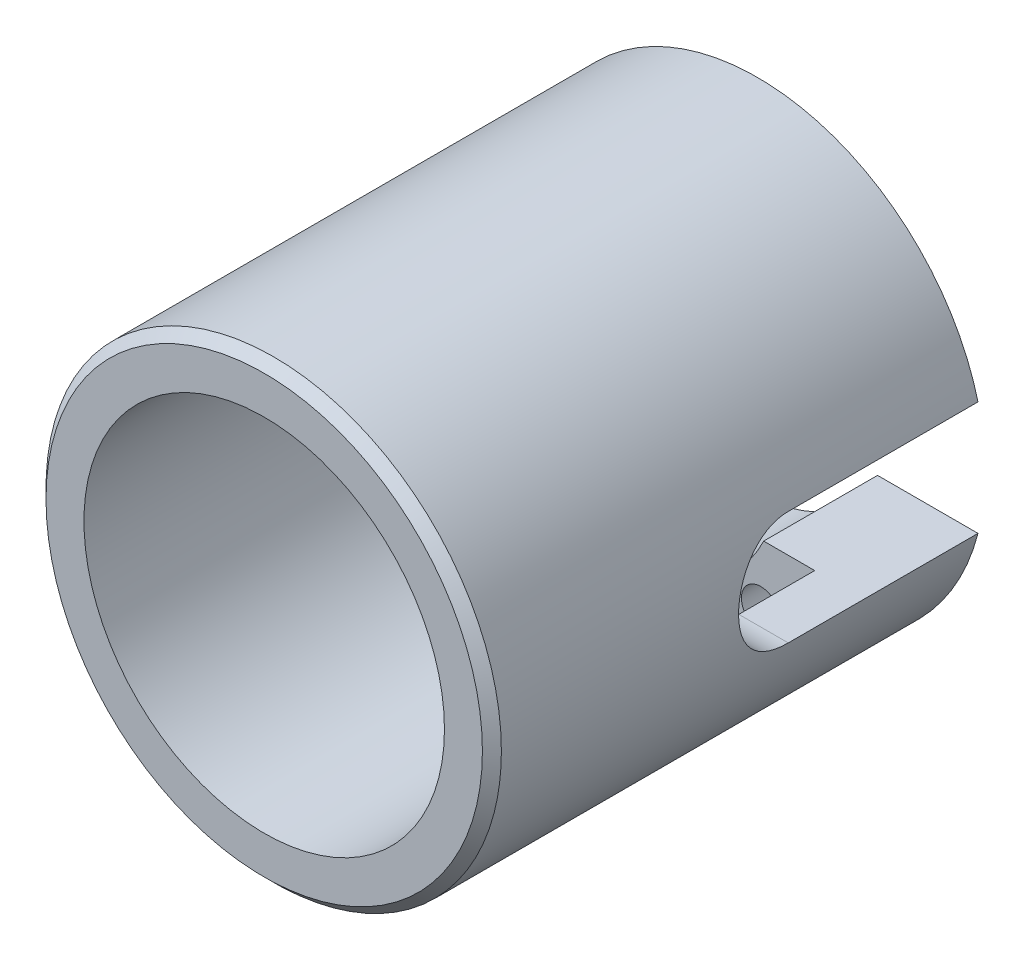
ISO-10303-21;
HEADER;
FILE_DESCRIPTION(('STEP AP214'),'2;1');
FILE_NAME('part.step','',(''),(''),'','','');
FILE_SCHEMA(('AUTOMOTIVE_DESIGN { 1 0 10303 214 1 1 1 1 }'));
ENDSEC;
DATA;
#1=APPLICATION_CONTEXT('core data for automotive mechanical design processes');
#2=APPLICATION_PROTOCOL_DEFINITION('international standard','automotive_design',2000,#1);
#3=PRODUCT_CONTEXT('',#1,'mechanical');
#4=PRODUCT('Part','Part','',(#3));
#5=PRODUCT_RELATED_PRODUCT_CATEGORY('part','',(#4));
#6=PRODUCT_DEFINITION_FORMATION('','',#4);
#7=PRODUCT_DEFINITION_CONTEXT('part definition',#1,'design');
#8=PRODUCT_DEFINITION('design','',#6,#7);
#9=PRODUCT_DEFINITION_SHAPE('','',#8);
#10=(LENGTH_UNIT() NAMED_UNIT(*) SI_UNIT(.MILLI.,.METRE.));
#11=(NAMED_UNIT(*) PLANE_ANGLE_UNIT() SI_UNIT($,.RADIAN.));
#12=(NAMED_UNIT(*) SI_UNIT($,.STERADIAN.) SOLID_ANGLE_UNIT());
#13=UNCERTAINTY_MEASURE_WITH_UNIT(LENGTH_MEASURE(1.E-05),#10,'distance_accuracy_value','');
#14=(GEOMETRIC_REPRESENTATION_CONTEXT(3) GLOBAL_UNCERTAINTY_ASSIGNED_CONTEXT((#13)) GLOBAL_UNIT_ASSIGNED_CONTEXT((#10,
#11,#12)) REPRESENTATION_CONTEXT('',''));
#15=CARTESIAN_POINT('',(0.,0.,0.));
#16=DIRECTION('',(0.,0.,1.));
#17=DIRECTION('',(1.,0.,0.));
#18=AXIS2_PLACEMENT_3D('',#15,#16,#17);
#19=CARTESIAN_POINT('',(12.4268287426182,0.,10.));
#20=DIRECTION('',(1.,0.,0.));
#21=DIRECTION('',(0.,1.,0.));
#22=AXIS2_PLACEMENT_3D('',#19,#20,#21);
#23=CYLINDRICAL_SURFACE('',#22,3.);
#24=DIRECTION('',(-1.,0.,0.));
#25=VECTOR('',#24,1.);
#26=CARTESIAN_POINT('',(12.4268287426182,3.,10.));
#27=LINE('',#26,#25);
#28=CARTESIAN_POINT('',(11.6189500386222,3.,10.));
#29=VERTEX_POINT('',#28);
#30=CARTESIAN_POINT('',(9.01387818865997,3.,10.));
#31=VERTEX_POINT('',#30);
#32=EDGE_CURVE('E224',#29,#31,#27,.T.);
#33=ORIENTED_EDGE('',*,*,#32,.F.);
#34=CARTESIAN_POINT('',(11.6189500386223,-3.,10.));
#35=CARTESIAN_POINT('',(11.6189407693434,-3.00000961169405,10.0829652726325));
#36=CARTESIAN_POINT('',(11.6198384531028,-2.99655852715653,10.1659248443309));
#37=CARTESIAN_POINT('',(11.6233789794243,-2.98280961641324,10.331223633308));
#38=CARTESIAN_POINT('',(11.62602152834,-2.97251294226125,10.4135629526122));
#39=CARTESIAN_POINT('',(11.6329762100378,-2.94517446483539,10.5768792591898));
#40=CARTESIAN_POINT('',(11.6372850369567,-2.92814601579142,10.657858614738));
#41=CARTESIAN_POINT('',(11.6474360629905,-2.88750212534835,10.8180264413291));
#42=CARTESIAN_POINT('',(11.6532782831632,-2.86388659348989,10.8972148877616));
#43=CARTESIAN_POINT('',(11.6728606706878,-2.78341765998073,11.1312548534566));
#44=CARTESIAN_POINT('',(11.6886639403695,-2.71691467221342,11.2827422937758));
#45=CARTESIAN_POINT('',(11.7239753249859,-2.56023632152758,11.5723719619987));
#46=CARTESIAN_POINT('',(11.7434843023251,-2.47005544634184,11.7105110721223));
#47=CARTESIAN_POINT('',(11.7844856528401,-2.26646573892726,11.9726094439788));
#48=CARTESIAN_POINT('',(11.8060094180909,-2.15263608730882,12.0962375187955));
#49=CARTESIAN_POINT('',(11.8483490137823,-1.90585219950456,12.3228882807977));
#50=CARTESIAN_POINT('',(11.8691645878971,-1.77289112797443,12.425903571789));
#51=CARTESIAN_POINT('',(11.9080953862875,-1.48930319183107,12.6097785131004));
#52=CARTESIAN_POINT('',(11.9261675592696,-1.33845014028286,12.6902989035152));
#53=CARTESIAN_POINT('',(11.95718331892,-1.02492691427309,12.8246307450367));
#54=CARTESIAN_POINT('',(11.9701330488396,-0.862271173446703,12.878474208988));
#55=CARTESIAN_POINT('',(11.9864067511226,-0.582335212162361,12.9452683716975));
#56=CARTESIAN_POINT('',(11.9914778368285,-0.466898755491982,12.9657573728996));
#57=CARTESIAN_POINT('',(11.9982759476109,-0.234324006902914,12.9931256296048));
#58=CARTESIAN_POINT('',(12.0000030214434,-0.11718573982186,13.0000050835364));
#59=CARTESIAN_POINT('',(11.9999957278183,0.165695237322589,12.9999928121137));
#60=CARTESIAN_POINT('',(11.9965325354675,0.331485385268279,12.9862216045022));
#61=CARTESIAN_POINT('',(11.9830465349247,0.658356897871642,12.9315661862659));
#62=CARTESIAN_POINT('',(11.9730174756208,0.819433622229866,12.8906561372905));
#63=CARTESIAN_POINT('',(11.94751204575,1.13204464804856,12.7831197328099));
#64=CARTESIAN_POINT('',(11.9320431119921,1.28359164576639,12.7165284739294));
#65=CARTESIAN_POINT('',(11.8973057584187,1.57335294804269,12.5596318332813));
#66=CARTESIAN_POINT('',(11.8780374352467,1.71156759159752,12.4693270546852));
#67=CARTESIAN_POINT('',(11.8373487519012,1.97360061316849,12.2656010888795));
#68=CARTESIAN_POINT('',(11.8158951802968,2.09710544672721,12.1517832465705));
#69=CARTESIAN_POINT('',(11.7734733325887,2.32349328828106,11.9051006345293));
#70=CARTESIAN_POINT('',(11.752505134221,2.4263730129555,11.7722328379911));
#71=CARTESIAN_POINT('',(11.7130897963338,2.6100798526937,11.4887714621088));
#72=CARTESIAN_POINT('',(11.6946856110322,2.69054967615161,11.3379400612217));
#73=CARTESIAN_POINT('',(11.662981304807,2.82482847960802,11.0243901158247));
#74=CARTESIAN_POINT('',(11.6496773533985,2.8786574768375,10.8616806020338));
#75=CARTESIAN_POINT('',(11.6329503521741,2.94537917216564,10.5817486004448));
#76=CARTESIAN_POINT('',(11.6277339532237,2.96583007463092,10.4663789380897));
#77=CARTESIAN_POINT('',(11.6207190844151,2.99314899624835,10.2340269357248));
#78=CARTESIAN_POINT('',(11.6189181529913,3.00002679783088,10.1170458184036));
#79=CARTESIAN_POINT('',(11.6189500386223,3.,10.));
#80=B_SPLINE_CURVE_WITH_KNOTS('',3,(#34,#35,#36,#37,#38,#39,#40,#41,#42,#43,#44,#45,#46,#47,#48,
#49,#50,#51,#52,#53,#54,#55,#56,#57,#58,#59,#60,#61,#62,#63,#64,#65,#66,#67,#68,#69,#70,#71,#72,
#73,#74,#75,#76,#77,#78,#79),.UNSPECIFIED.,.F.,.F.,(4,2,2,2,2,2,2,2,2,2,2,2,2,2,2,2,2,2,2,2,2,2,
4),(0.,0.248809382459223,0.497576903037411,0.745853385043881,0.994133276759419,1.49020799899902,
1.98639831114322,2.49231887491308,2.99842064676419,3.51178726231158,4.02453632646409,
4.37579155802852,4.72704166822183,5.22369314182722,5.7208181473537,6.21726616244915,
6.71370155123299,7.219318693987,7.72501626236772,8.23836673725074,8.75133090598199,
9.10238460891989,9.45318520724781),.UNSPECIFIED.);
#81=CARTESIAN_POINT('',(11.6189500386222,-3.,10.));
#82=VERTEX_POINT('',#81);
#83=EDGE_CURVE('E232',#82,#29,#80,.T.);
#84=ORIENTED_EDGE('',*,*,#83,.F.);
#85=DIRECTION('',(1.,0.,0.));
#86=VECTOR('',#85,1.);
#87=CARTESIAN_POINT('',(12.4268287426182,-3.,10.));
#88=LINE('',#87,#86);
#89=CARTESIAN_POINT('',(9.01387818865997,-3.,10.));
#90=VERTEX_POINT('',#89);
#91=EDGE_CURVE('E104',#90,#82,#88,.T.);
#92=ORIENTED_EDGE('',*,*,#91,.F.);
#93=CARTESIAN_POINT('',(9.01387818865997,3.,10.));
#94=CARTESIAN_POINT('',(9.01386597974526,3.00001051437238,10.0821116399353));
#95=CARTESIAN_POINT('',(9.01499989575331,2.99662905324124,10.1642163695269));
#96=CARTESIAN_POINT('',(9.01946917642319,2.98316402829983,10.3277945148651));
#97=CARTESIAN_POINT('',(9.0228040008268,2.97308210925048,10.4092680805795));
#98=CARTESIAN_POINT('',(9.03157241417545,2.94633444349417,10.5707868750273));
#99=CARTESIAN_POINT('',(9.03700025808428,2.92968671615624,10.6508353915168));
#100=CARTESIAN_POINT('',(9.04977800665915,2.88997409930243,10.8091467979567));
#101=CARTESIAN_POINT('',(9.05712797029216,2.86690901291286,10.8874096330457));
#102=CARTESIAN_POINT('',(9.08173875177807,2.78838078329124,11.1186436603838));
#103=CARTESIAN_POINT('',(9.10157322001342,2.72354809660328,11.2682787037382));
#104=CARTESIAN_POINT('',(9.14584807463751,2.57094111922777,11.5545539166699));
#105=CARTESIAN_POINT('',(9.17029077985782,2.48315527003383,11.6911874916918));
#106=CARTESIAN_POINT('',(9.22198167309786,2.28384828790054,11.9523961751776));
#107=CARTESIAN_POINT('',(9.24929403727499,2.17166578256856,12.0764549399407));
#108=CARTESIAN_POINT('',(9.30310788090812,1.92813702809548,12.3043688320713));
#109=CARTESIAN_POINT('',(9.32960907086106,1.79678403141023,12.4082168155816));
#110=CARTESIAN_POINT('',(9.37955981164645,1.51486358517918,12.5950826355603));
#111=CARTESIAN_POINT('',(9.40292283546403,1.36391659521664,12.6775525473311));
#112=CARTESIAN_POINT('',(9.44317204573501,1.04952659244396,12.8156516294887));
#113=CARTESIAN_POINT('',(9.46006613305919,0.886099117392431,12.8713135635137));
#114=CARTESIAN_POINT('',(9.48166486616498,0.601609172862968,12.9415462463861));
#115=CARTESIAN_POINT('',(9.4885027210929,0.482461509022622,12.9634229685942));
#116=CARTESIAN_POINT('',(9.49767198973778,0.242224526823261,12.9926520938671));
#117=CARTESIAN_POINT('',(9.50000360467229,0.121135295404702,13.0000051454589));
#118=CARTESIAN_POINT('',(9.49999511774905,-0.164068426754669,12.9999930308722));
#119=CARTESIAN_POINT('',(9.49570636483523,-0.3282213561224,12.9864877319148));
#120=CARTESIAN_POINT('',(9.47900236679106,-0.651793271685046,12.9329355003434));
#121=CARTESIAN_POINT('',(9.46658001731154,-0.811207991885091,12.8928653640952));
#122=CARTESIAN_POINT('',(9.43496972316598,-1.12047972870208,12.7876788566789));
#123=CARTESIAN_POINT('',(9.41579429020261,-1.27035381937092,12.7226087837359));
#124=CARTESIAN_POINT('',(9.37265477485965,-1.55704458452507,12.5694435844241));
#125=CARTESIAN_POINT('',(9.34869041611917,-1.69386050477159,12.4813471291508));
#126=CARTESIAN_POINT('',(9.29766824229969,-1.95488223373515,12.2817083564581));
#127=CARTESIAN_POINT('',(9.27054192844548,-2.07861987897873,12.169571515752));
#128=CARTESIAN_POINT('',(9.21664494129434,-2.30588940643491,11.9262896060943));
#129=CARTESIAN_POINT('',(9.18987435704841,-2.40941631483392,11.7951398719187));
#130=CARTESIAN_POINT('',(9.1389775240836,-2.59590047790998,11.5134583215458));
#131=CARTESIAN_POINT('',(9.11493669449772,-2.67826214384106,11.3625157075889));
#132=CARTESIAN_POINT('',(9.07327414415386,-2.81618836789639,11.0480887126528));
#133=CARTESIAN_POINT('',(9.05564638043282,-2.87177816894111,10.8846163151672));
#134=CARTESIAN_POINT('',(9.03309323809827,-2.9417963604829,10.6003132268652));
#135=CARTESIAN_POINT('',(9.02594299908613,-2.96357245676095,10.4814193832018));
#136=CARTESIAN_POINT('',(9.01631062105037,-2.9926918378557,10.2417096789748));
#137=CARTESIAN_POINT('',(9.01382793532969,-3.00003681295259,10.1208940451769));
#138=CARTESIAN_POINT('',(9.01387818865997,-3.,10.));
#139=B_SPLINE_CURVE_WITH_KNOTS('',3,(#93,#94,#95,#96,#97,#98,#99,#100,#101,#102,#103,#104,#105,
#106,#107,#108,#109,#110,#111,#112,#113,#114,#115,#116,#117,#118,#119,#120,#121,#122,#123,#124,
#125,#126,#127,#128,#129,#130,#131,#132,#133,#134,#135,#136,#137,#138),.UNSPECIFIED.,.F.,.F.,(4,
2,2,2,2,2,2,2,2,2,2,2,2,2,2,2,2,2,2,2,2,2,4),(0.,0.246245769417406,0.492431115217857,
0.737945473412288,0.983467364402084,1.47385429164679,1.96448863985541,2.47059997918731,
2.97688988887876,3.49509860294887,4.01267236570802,4.37575969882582,4.73883081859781,
5.23058268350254,5.72276464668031,6.21403948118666,6.70534267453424,7.210591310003,
7.71596412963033,8.23429711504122,8.752140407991,9.11447353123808,9.47676421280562),.UNSPECIFIED.);
#140=EDGE_CURVE('E20',#31,#90,#139,.T.);
#141=ORIENTED_EDGE('',*,*,#140,.F.);
#142=EDGE_LOOP('',(#33,#84,#92,#141));
#143=FACE_BOUND('',#142,.T.);
#144=ADVANCED_FACE('F16',(#143),#23,.F.);
#145=CARTESIAN_POINT('',(-6.17304219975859,-6.17304219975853,6.35));
#146=DIRECTION('',(0.,0.,-1.));
#147=DIRECTION('',(-1.,0.,0.));
#148=AXIS2_PLACEMENT_3D('',#145,#146,#147);
#149=CONICAL_SURFACE('',#148,1.02499999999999,1.02974425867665);
#150=CARTESIAN_POINT('',(-7.19768039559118,-6.20027393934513,6.35));
#151=CARTESIAN_POINT('',(-7.17825162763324,-6.22282768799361,6.36130489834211));
#152=CARTESIAN_POINT('',(-7.1586324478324,-6.24538894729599,6.37226664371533));
#153=CARTESIAN_POINT('',(-7.11896647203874,-6.29056610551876,6.3933326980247));
#154=CARTESIAN_POINT('',(-7.09891938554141,-6.3131820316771,6.40343639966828));
#155=CARTESIAN_POINT('',(-7.03777387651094,-6.38149630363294,6.43233768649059));
#156=CARTESIAN_POINT('',(-6.99598984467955,-6.42729071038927,6.44953334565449));
#157=CARTESIAN_POINT('',(-6.91253904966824,-6.5169293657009,6.47698019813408));
#158=CARTESIAN_POINT('',(-6.87096073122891,-6.56076308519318,6.48752209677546));
#159=CARTESIAN_POINT('',(-6.78652087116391,-6.64806715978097,6.50104549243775));
#160=CARTESIAN_POINT('',(-6.74366574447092,-6.69153826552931,6.50405988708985));
#161=CARTESIAN_POINT('',(-6.65994421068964,-6.77483668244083,6.50202831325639));
#162=CARTESIAN_POINT('',(-6.61912162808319,-6.81472153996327,6.49747597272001));
#163=CARTESIAN_POINT('',(-6.53725692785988,-6.89329448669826,6.48207411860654));
#164=CARTESIAN_POINT('',(-6.49621458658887,-6.93197713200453,6.47119941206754));
#165=CARTESIAN_POINT('',(-6.41240444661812,-7.00959960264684,6.44405605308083));
#166=CARTESIAN_POINT('',(-6.36964590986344,-7.04846654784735,6.42755853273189));
#167=CARTESIAN_POINT('',(-6.30582829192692,-7.10544400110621,6.40016894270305));
#168=CARTESIAN_POINT('',(-6.28468938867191,-7.12414692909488,6.3906399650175));
#169=CARTESIAN_POINT('',(-6.24245602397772,-7.16118218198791,6.37084074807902));
#170=CARTESIAN_POINT('',(-6.22136154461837,-7.17951470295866,6.36057091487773));
#171=CARTESIAN_POINT('',(-6.2002739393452,-7.19768039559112,6.35));
#172=B_SPLINE_CURVE_WITH_KNOTS('',3,(#150,#151,#152,#153,#154,#155,#156,#157,#158,#159,#160,
#161,#162,#163,#164,#165,#166,#167,#168,#169,#170,#171),.UNSPECIFIED.,.F.,.F.,(4,2,2,2,2,2,2,2,
2,2,4),(0.,0.095521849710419,0.191110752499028,0.383860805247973,0.567468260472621,
0.75027187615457,0.921611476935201,1.09363854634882,1.27372629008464,1.36308894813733,
1.45240299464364),.UNSPECIFIED.);
#173=CARTESIAN_POINT('',(-7.19768039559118,-6.20027393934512,6.35));
#174=VERTEX_POINT('',#173);
#175=CARTESIAN_POINT('',(-6.2002739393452,-7.19768039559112,6.35));
#176=VERTEX_POINT('',#175);
#177=EDGE_CURVE('E201',#174,#176,#172,.T.);
#178=ORIENTED_EDGE('',*,*,#177,.T.);
#179=CARTESIAN_POINT('',(-6.17304219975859,-6.17304219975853,6.35));
#180=DIRECTION('',(0.,0.,-1.));
#181=DIRECTION('',(-1.,0.,0.));
#182=AXIS2_PLACEMENT_3D('',#179,#180,#181);
#183=CIRCLE('',#182,1.02499999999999);
#184=EDGE_CURVE('E233',#176,#174,#183,.T.);
#185=ORIENTED_EDGE('',*,*,#184,.T.);
#186=EDGE_LOOP('',(#178,#185));
#187=FACE_BOUND('',#186,.T.);
#188=ADVANCED_FACE('F308',(#187),#149,.F.);
#189=CARTESIAN_POINT('',(6.17304219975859,-6.17304219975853,6.35));
#190=DIRECTION('',(0.,0.,-1.));
#191=DIRECTION('',(-1.,0.,0.));
#192=AXIS2_PLACEMENT_3D('',#189,#190,#191);
#193=CONICAL_SURFACE('',#192,1.02499999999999,1.02974425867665);
#194=CARTESIAN_POINT('',(6.2002739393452,-7.19768039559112,6.35));
#195=CARTESIAN_POINT('',(6.22282768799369,-7.17825162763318,6.36130489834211));
#196=CARTESIAN_POINT('',(6.24538894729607,-7.15863244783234,6.37226664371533));
#197=CARTESIAN_POINT('',(6.29056610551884,-7.11896647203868,6.3933326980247));
#198=CARTESIAN_POINT('',(6.31318203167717,-7.09891938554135,6.40343639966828));
#199=CARTESIAN_POINT('',(6.38149630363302,-7.03777387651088,6.43233768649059));
#200=CARTESIAN_POINT('',(6.42729071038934,-6.99598984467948,6.44953334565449));
#201=CARTESIAN_POINT('',(6.51692936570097,-6.91253904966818,6.47698019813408));
#202=CARTESIAN_POINT('',(6.56076308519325,-6.87096073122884,6.48752209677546));
#203=CARTESIAN_POINT('',(6.64806715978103,-6.78652087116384,6.50104549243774));
#204=CARTESIAN_POINT('',(6.69153826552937,-6.74366574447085,6.50405988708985));
#205=CARTESIAN_POINT('',(6.77483668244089,-6.65994421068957,6.50202831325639));
#206=CARTESIAN_POINT('',(6.81472153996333,-6.61912162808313,6.49747597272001));
#207=CARTESIAN_POINT('',(6.89329448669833,-6.53725692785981,6.48207411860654));
#208=CARTESIAN_POINT('',(6.9319771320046,-6.4962145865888,6.47119941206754));
#209=CARTESIAN_POINT('',(7.0095996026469,-6.41240444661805,6.44405605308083));
#210=CARTESIAN_POINT('',(7.04846654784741,-6.36964590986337,6.42755853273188));
#211=CARTESIAN_POINT('',(7.10544400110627,-6.30582829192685,6.40016894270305));
#212=CARTESIAN_POINT('',(7.12414692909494,-6.28468938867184,6.39063996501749));
#213=CARTESIAN_POINT('',(7.16118218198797,-6.24245602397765,6.37084074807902));
#214=CARTESIAN_POINT('',(7.17951470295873,-6.2213615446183,6.36057091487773));
#215=CARTESIAN_POINT('',(7.19768039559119,-6.20027393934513,6.35));
#216=B_SPLINE_CURVE_WITH_KNOTS('',3,(#194,#195,#196,#197,#198,#199,#200,#201,#202,#203,#204,
#205,#206,#207,#208,#209,#210,#211,#212,#213,#214,#215),.UNSPECIFIED.,.F.,.F.,(4,2,2,2,2,2,2,2,
2,2,4),(0.,0.0955218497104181,0.191110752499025,0.383860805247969,0.567468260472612,
0.75027187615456,0.921611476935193,1.09363854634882,1.27372629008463,1.36308894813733,
1.45240299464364),.UNSPECIFIED.);
#217=CARTESIAN_POINT('',(6.2002739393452,-7.19768039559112,6.35));
#218=VERTEX_POINT('',#217);
#219=CARTESIAN_POINT('',(7.19768039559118,-6.20027393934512,6.35));
#220=VERTEX_POINT('',#219);
#221=EDGE_CURVE('E96',#218,#220,#216,.T.);
#222=ORIENTED_EDGE('',*,*,#221,.T.);
#223=CARTESIAN_POINT('',(6.17304219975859,-6.17304219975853,6.35));
#224=DIRECTION('',(0.,0.,-1.));
#225=DIRECTION('',(-1.,0.,0.));
#226=AXIS2_PLACEMENT_3D('',#223,#224,#225);
#227=CIRCLE('',#226,1.02499999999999);
#228=EDGE_CURVE('E245',#220,#218,#227,.T.);
#229=ORIENTED_EDGE('',*,*,#228,.T.);
#230=EDGE_LOOP('',(#222,#229));
#231=FACE_BOUND('',#230,.T.);
#232=ADVANCED_FACE('F311',(#231),#193,.F.);
#233=CARTESIAN_POINT('',(6.17304219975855,6.17304219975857,6.35));
#234=DIRECTION('',(0.,0.,-1.));
#235=DIRECTION('',(-1.,0.,0.));
#236=AXIS2_PLACEMENT_3D('',#233,#234,#235);
#237=CONICAL_SURFACE('',#236,1.02499999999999,1.02974425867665);
#238=CARTESIAN_POINT('',(7.19768039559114,6.20027393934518,6.35));
#239=CARTESIAN_POINT('',(7.17825162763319,6.22282768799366,6.36130489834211));
#240=CARTESIAN_POINT('',(7.15863244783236,6.24538894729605,6.37226664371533));
#241=CARTESIAN_POINT('',(7.11896647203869,6.29056610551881,6.3933326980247));
#242=CARTESIAN_POINT('',(7.09891938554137,6.31318203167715,6.40343639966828));
#243=CARTESIAN_POINT('',(7.0377738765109,6.38149630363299,6.43233768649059));
#244=CARTESIAN_POINT('',(6.9959898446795,6.42729071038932,6.44953334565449));
#245=CARTESIAN_POINT('',(6.91253904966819,6.51692936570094,6.47698019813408));
#246=CARTESIAN_POINT('',(6.87096073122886,6.56076308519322,6.48752209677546));
#247=CARTESIAN_POINT('',(6.78652087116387,6.64806715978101,6.50104549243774));
#248=CARTESIAN_POINT('',(6.74366574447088,6.69153826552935,6.50405988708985));
#249=CARTESIAN_POINT('',(6.65994421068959,6.77483668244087,6.50202831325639));
#250=CARTESIAN_POINT('',(6.61912162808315,6.81472153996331,6.49747597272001));
#251=CARTESIAN_POINT('',(6.53725692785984,6.89329448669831,6.48207411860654));
#252=CARTESIAN_POINT('',(6.49621458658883,6.93197713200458,6.47119941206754));
#253=CARTESIAN_POINT('',(6.41240444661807,7.00959960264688,6.44405605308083));
#254=CARTESIAN_POINT('',(6.36964590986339,7.04846654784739,6.42755853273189));
#255=CARTESIAN_POINT('',(6.30582829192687,7.10544400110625,6.40016894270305));
#256=CARTESIAN_POINT('',(6.28468938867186,7.12414692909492,6.39063996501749));
#257=CARTESIAN_POINT('',(6.24245602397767,7.16118218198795,6.37084074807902));
#258=CARTESIAN_POINT('',(6.22136154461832,7.17951470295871,6.36057091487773));
#259=CARTESIAN_POINT('',(6.20027393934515,7.19768039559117,6.35));
#260=B_SPLINE_CURVE_WITH_KNOTS('',3,(#238,#239,#240,#241,#242,#243,#244,#245,#246,#247,#248,
#249,#250,#251,#252,#253,#254,#255,#256,#257,#258,#259),.UNSPECIFIED.,.F.,.F.,(4,2,2,2,2,2,2,2,
2,2,4),(0.,0.0955218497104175,0.191110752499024,0.383860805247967,0.56746826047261,
0.750271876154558,0.921611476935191,1.09363854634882,1.27372629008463,1.36308894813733,
1.45240299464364),.UNSPECIFIED.);
#261=CARTESIAN_POINT('',(7.19768039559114,6.20027393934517,6.35));
#262=VERTEX_POINT('',#261);
#263=CARTESIAN_POINT('',(6.20027393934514,7.19768039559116,6.35));
#264=VERTEX_POINT('',#263);
#265=EDGE_CURVE('E262',#262,#264,#260,.T.);
#266=ORIENTED_EDGE('',*,*,#265,.T.);
#267=CARTESIAN_POINT('',(6.17304219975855,6.17304219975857,6.35));
#268=DIRECTION('',(0.,0.,-1.));
#269=DIRECTION('',(-1.,0.,0.));
#270=AXIS2_PLACEMENT_3D('',#267,#268,#269);
#271=CIRCLE('',#270,1.02499999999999);
#272=EDGE_CURVE('E10',#264,#262,#271,.T.);
#273=ORIENTED_EDGE('',*,*,#272,.T.);
#274=EDGE_LOOP('',(#266,#273));
#275=FACE_BOUND('',#274,.T.);
#276=ADVANCED_FACE('F278',(#275),#237,.F.);
#277=CARTESIAN_POINT('',(-6.17304219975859,6.17304219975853,6.35));
#278=DIRECTION('',(0.,0.,-1.));
#279=DIRECTION('',(-1.,0.,0.));
#280=AXIS2_PLACEMENT_3D('',#277,#278,#279);
#281=CONICAL_SURFACE('',#280,1.02499999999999,1.02974425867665);
#282=CARTESIAN_POINT('',(-6.2002739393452,7.19768039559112,6.35));
#283=CARTESIAN_POINT('',(-6.22282768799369,7.17825162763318,6.36130489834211));
#284=CARTESIAN_POINT('',(-6.24538894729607,7.15863244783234,6.37226664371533));
#285=CARTESIAN_POINT('',(-6.29056610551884,7.11896647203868,6.3933326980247));
#286=CARTESIAN_POINT('',(-6.31318203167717,7.09891938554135,6.40343639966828));
#287=CARTESIAN_POINT('',(-6.38149630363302,7.03777387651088,6.43233768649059));
#288=CARTESIAN_POINT('',(-6.42729071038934,6.99598984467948,6.44953334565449));
#289=CARTESIAN_POINT('',(-6.51692936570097,6.91253904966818,6.47698019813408));
#290=CARTESIAN_POINT('',(-6.56076308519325,6.87096073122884,6.48752209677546));
#291=CARTESIAN_POINT('',(-6.64806715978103,6.78652087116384,6.50104549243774));
#292=CARTESIAN_POINT('',(-6.69153826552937,6.74366574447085,6.50405988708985));
#293=CARTESIAN_POINT('',(-6.77483668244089,6.65994421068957,6.50202831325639));
#294=CARTESIAN_POINT('',(-6.81472153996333,6.61912162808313,6.49747597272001));
#295=CARTESIAN_POINT('',(-6.89329448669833,6.53725692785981,6.48207411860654));
#296=CARTESIAN_POINT('',(-6.9319771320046,6.4962145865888,6.47119941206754));
#297=CARTESIAN_POINT('',(-7.0095996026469,6.41240444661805,6.44405605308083));
#298=CARTESIAN_POINT('',(-7.04846654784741,6.36964590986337,6.42755853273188));
#299=CARTESIAN_POINT('',(-7.10544400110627,6.30582829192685,6.40016894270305));
#300=CARTESIAN_POINT('',(-7.12414692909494,6.28468938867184,6.39063996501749));
#301=CARTESIAN_POINT('',(-7.16118218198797,6.24245602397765,6.37084074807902));
#302=CARTESIAN_POINT('',(-7.17951470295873,6.2213615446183,6.36057091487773));
#303=CARTESIAN_POINT('',(-7.19768039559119,6.20027393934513,6.35));
#304=B_SPLINE_CURVE_WITH_KNOTS('',3,(#282,#283,#284,#285,#286,#287,#288,#289,#290,#291,#292,
#293,#294,#295,#296,#297,#298,#299,#300,#301,#302,#303),.UNSPECIFIED.,.F.,.F.,(4,2,2,2,2,2,2,2,
2,2,4),(0.,0.0955218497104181,0.191110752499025,0.383860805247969,0.567468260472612,
0.75027187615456,0.921611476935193,1.09363854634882,1.27372629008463,1.36308894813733,
1.45240299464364),.UNSPECIFIED.);
#305=CARTESIAN_POINT('',(-6.2002739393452,7.19768039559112,6.35));
#306=VERTEX_POINT('',#305);
#307=CARTESIAN_POINT('',(-7.19768039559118,6.20027393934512,6.35));
#308=VERTEX_POINT('',#307);
#309=EDGE_CURVE('E206',#306,#308,#304,.T.);
#310=ORIENTED_EDGE('',*,*,#309,.T.);
#311=CARTESIAN_POINT('',(-6.17304219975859,6.17304219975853,6.35));
#312=DIRECTION('',(0.,0.,-1.));
#313=DIRECTION('',(-1.,0.,0.));
#314=AXIS2_PLACEMENT_3D('',#311,#312,#313);
#315=CIRCLE('',#314,1.02499999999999);
#316=EDGE_CURVE('E32',#308,#306,#315,.T.);
#317=ORIENTED_EDGE('',*,*,#316,.T.);
#318=EDGE_LOOP('',(#310,#317));
#319=FACE_BOUND('',#318,.T.);
#320=ADVANCED_FACE('F390',(#319),#281,.F.);
#321=CARTESIAN_POINT('',(12.4268287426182,-3.,13.));
#322=DIRECTION('',(0.,-1.,0.));
#323=DIRECTION('',(-1.,0.,0.));
#324=AXIS2_PLACEMENT_3D('',#321,#322,#323);
#325=PLANE('',#324);
#326=DIRECTION('',(0.,0.,1.));
#327=VECTOR('',#326,1.);
#328=CARTESIAN_POINT('',(9.01387818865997,-3.,26.));
#329=LINE('',#328,#327);
#330=CARTESIAN_POINT('',(9.01387818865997,-3.,6.));
#331=VERTEX_POINT('',#330);
#332=EDGE_CURVE('E258',#331,#90,#329,.T.);
#333=ORIENTED_EDGE('',*,*,#332,.T.);
#334=ORIENTED_EDGE('',*,*,#91,.T.);
#335=DIRECTION('',(0.,0.,1.));
#336=VECTOR('',#335,1.);
#337=CARTESIAN_POINT('',(11.6189500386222,-3.,6.));
#338=LINE('',#337,#336);
#339=CARTESIAN_POINT('',(11.6189500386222,-3.,0.));
#340=VERTEX_POINT('',#339);
#341=EDGE_CURVE('E217',#340,#82,#338,.T.);
#342=ORIENTED_EDGE('',*,*,#341,.F.);
#343=DIRECTION('',(-1.,0.,0.));
#344=VECTOR('',#343,1.);
#345=CARTESIAN_POINT('',(12.4268287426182,-3.,0.));
#346=LINE('',#345,#344);
#347=CARTESIAN_POINT('',(6.32455532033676,-3.,0.));
#348=VERTEX_POINT('',#347);
#349=EDGE_CURVE('E367',#340,#348,#346,.T.);
#350=ORIENTED_EDGE('',*,*,#349,.T.);
#351=DIRECTION('',(0.,0.,1.));
#352=VECTOR('',#351,1.);
#353=CARTESIAN_POINT('',(6.32455532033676,-3.,6.));
#354=LINE('',#353,#352);
#355=CARTESIAN_POINT('',(6.32455532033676,-3.,6.));
#356=VERTEX_POINT('',#355);
#357=EDGE_CURVE('E207',#348,#356,#354,.T.);
#358=ORIENTED_EDGE('',*,*,#357,.T.);
#359=DIRECTION('',(1.,0.,0.));
#360=VECTOR('',#359,1.);
#361=CARTESIAN_POINT('',(0.,-3.,6.));
#362=LINE('',#361,#360);
#363=EDGE_CURVE('E117',#356,#331,#362,.T.);
#364=ORIENTED_EDGE('',*,*,#363,.T.);
#365=EDGE_LOOP('',(#333,#334,#342,#350,#358,#364));
#366=FACE_BOUND('',#365,.T.);
#367=ADVANCED_FACE('F519',(#366),#325,.F.);
#368=CARTESIAN_POINT('',(12.4268287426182,3.,13.));
#369=DIRECTION('',(0.,1.,0.));
#370=DIRECTION('',(1.,0.,0.));
#371=AXIS2_PLACEMENT_3D('',#368,#369,#370);
#372=PLANE('',#371);
#373=DIRECTION('',(0.,0.,-1.));
#374=VECTOR('',#373,1.);
#375=CARTESIAN_POINT('',(11.6189500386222,3.,6.));
#376=LINE('',#375,#374);
#377=CARTESIAN_POINT('',(11.6189500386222,3.,0.));
#378=VERTEX_POINT('',#377);
#379=EDGE_CURVE('E228',#29,#378,#376,.T.);
#380=ORIENTED_EDGE('',*,*,#379,.F.);
#381=ORIENTED_EDGE('',*,*,#32,.T.);
#382=DIRECTION('',(0.,0.,-1.));
#383=VECTOR('',#382,1.);
#384=CARTESIAN_POINT('',(9.01387818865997,3.,26.));
#385=LINE('',#384,#383);
#386=CARTESIAN_POINT('',(9.01387818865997,3.,6.));
#387=VERTEX_POINT('',#386);
#388=EDGE_CURVE('E323',#31,#387,#385,.T.);
#389=ORIENTED_EDGE('',*,*,#388,.T.);
#390=DIRECTION('',(-1.,0.,0.));
#391=VECTOR('',#390,1.);
#392=CARTESIAN_POINT('',(0.,3.,6.));
#393=LINE('',#392,#391);
#394=CARTESIAN_POINT('',(6.32455532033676,3.,6.));
#395=VERTEX_POINT('',#394);
#396=EDGE_CURVE('E365',#387,#395,#393,.T.);
#397=ORIENTED_EDGE('',*,*,#396,.T.);
#398=DIRECTION('',(0.,0.,-1.));
#399=VECTOR('',#398,1.);
#400=CARTESIAN_POINT('',(6.32455532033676,3.,6.));
#401=LINE('',#400,#399);
#402=CARTESIAN_POINT('',(6.32455532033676,3.,0.));
#403=VERTEX_POINT('',#402);
#404=EDGE_CURVE('E334',#395,#403,#401,.T.);
#405=ORIENTED_EDGE('',*,*,#404,.T.);
#406=DIRECTION('',(1.,0.,0.));
#407=VECTOR('',#406,1.);
#408=CARTESIAN_POINT('',(12.4268287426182,3.,0.));
#409=LINE('',#408,#407);
#410=EDGE_CURVE('E327',#403,#378,#409,.T.);
#411=ORIENTED_EDGE('',*,*,#410,.T.);
#412=EDGE_LOOP('',(#380,#381,#389,#397,#405,#411));
#413=FACE_BOUND('',#412,.T.);
#414=ADVANCED_FACE('F325',(#413),#372,.F.);
#415=CARTESIAN_POINT('',(0.,0.,26.));
#416=DIRECTION('',(0.,0.,1.));
#417=DIRECTION('',(1.,0.,0.));
#418=AXIS2_PLACEMENT_3D('',#415,#416,#417);
#419=PLANE('',#418);
#420=CARTESIAN_POINT('',(0.,0.,26.));
#421=DIRECTION('',(0.,0.,1.));
#422=DIRECTION('',(1.,0.,0.));
#423=AXIS2_PLACEMENT_3D('',#420,#421,#422);
#424=CIRCLE('',#423,9.5);
#425=CARTESIAN_POINT('',(9.5,0.,26.));
#426=VERTEX_POINT('',#425);
#427=EDGE_CURVE('E355',#426,#426,#424,.T.);
#428=ORIENTED_EDGE('',*,*,#427,.F.);
#429=EDGE_LOOP('',(#428));
#430=FACE_BOUND('',#429,.T.);
#431=CARTESIAN_POINT('',(0.,0.,26.));
#432=DIRECTION('',(0.,0.,1.));
#433=DIRECTION('',(1.,0.,0.));
#434=AXIS2_PLACEMENT_3D('',#431,#432,#433);
#435=CIRCLE('',#434,11.5);
#436=CARTESIAN_POINT('',(11.5,0.,26.));
#437=VERTEX_POINT('',#436);
#438=EDGE_CURVE('E472',#437,#437,#435,.T.);
#439=ORIENTED_EDGE('',*,*,#438,.T.);
#440=EDGE_LOOP('',(#439));
#441=FACE_BOUND('',#440,.T.);
#442=ADVANCED_FACE('F648',(#430,#441),#419,.T.);
#443=CARTESIAN_POINT('',(0.,0.,6.));
#444=DIRECTION('',(0.,0.,1.));
#445=DIRECTION('',(1.,0.,0.));
#446=AXIS2_PLACEMENT_3D('',#443,#444,#445);
#447=PLANE('',#446);
#448=CARTESIAN_POINT('',(-6.17304219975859,-6.17304219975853,6.));
#449=DIRECTION('',(0.,0.,1.));
#450=DIRECTION('',(1.,0.,0.));
#451=AXIS2_PLACEMENT_3D('',#448,#449,#450);
#452=CIRCLE('',#451,1.02499999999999);
#453=CARTESIAN_POINT('',(-6.2002739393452,-7.19768039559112,6.));
#454=VERTEX_POINT('',#453);
#455=CARTESIAN_POINT('',(-7.19768039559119,-6.20027393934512,6.));
#456=VERTEX_POINT('',#455);
#457=EDGE_CURVE('E448',#454,#456,#452,.T.);
#458=ORIENTED_EDGE('',*,*,#457,.F.);
#459=CARTESIAN_POINT('',(0.,0.,6.));
#460=DIRECTION('',(0.,0.,1.));
#461=DIRECTION('',(1.,0.,0.));
#462=AXIS2_PLACEMENT_3D('',#459,#460,#461);
#463=CIRCLE('',#462,9.5);
#464=CARTESIAN_POINT('',(6.2002739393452,-7.19768039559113,6.));
#465=VERTEX_POINT('',#464);
#466=EDGE_CURVE('E303',#454,#465,#463,.T.);
#467=ORIENTED_EDGE('',*,*,#466,.T.);
#468=CARTESIAN_POINT('',(6.17304219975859,-6.17304219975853,6.));
#469=DIRECTION('',(0.,0.,1.));
#470=DIRECTION('',(1.,0.,0.));
#471=AXIS2_PLACEMENT_3D('',#468,#469,#470);
#472=CIRCLE('',#471,1.02499999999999);
#473=CARTESIAN_POINT('',(7.19768039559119,-6.20027393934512,6.));
#474=VERTEX_POINT('',#473);
#475=EDGE_CURVE('E244',#474,#465,#472,.T.);
#476=ORIENTED_EDGE('',*,*,#475,.F.);
#477=CARTESIAN_POINT('',(0.,0.,6.));
#478=DIRECTION('',(0.,0.,1.));
#479=DIRECTION('',(1.,0.,0.));
#480=AXIS2_PLACEMENT_3D('',#477,#478,#479);
#481=CIRCLE('',#480,9.5);
#482=EDGE_CURVE('E261',#474,#331,#481,.T.);
#483=ORIENTED_EDGE('',*,*,#482,.T.);
#484=ORIENTED_EDGE('',*,*,#363,.F.);
#485=CARTESIAN_POINT('',(0.,0.,6.));
#486=DIRECTION('',(0.,0.,1.));
#487=DIRECTION('',(1.,0.,0.));
#488=AXIS2_PLACEMENT_3D('',#485,#486,#487);
#489=CIRCLE('',#488,7.);
#490=EDGE_CURVE('E200',#395,#356,#489,.T.);
#491=ORIENTED_EDGE('',*,*,#490,.F.);
#492=ORIENTED_EDGE('',*,*,#396,.F.);
#493=CARTESIAN_POINT('',(0.,0.,6.));
#494=DIRECTION('',(0.,0.,1.));
#495=DIRECTION('',(1.,0.,0.));
#496=AXIS2_PLACEMENT_3D('',#493,#494,#495);
#497=CIRCLE('',#496,9.5);
#498=CARTESIAN_POINT('',(7.19768039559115,6.20027393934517,6.));
#499=VERTEX_POINT('',#498);
#500=EDGE_CURVE('E361',#387,#499,#497,.T.);
#501=ORIENTED_EDGE('',*,*,#500,.T.);
#502=CARTESIAN_POINT('',(6.17304219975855,6.17304219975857,6.));
#503=DIRECTION('',(0.,0.,1.));
#504=DIRECTION('',(1.,0.,0.));
#505=AXIS2_PLACEMENT_3D('',#502,#503,#504);
#506=CIRCLE('',#505,1.02499999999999);
#507=CARTESIAN_POINT('',(6.20027393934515,7.19768039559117,6.));
#508=VERTEX_POINT('',#507);
#509=EDGE_CURVE('E257',#508,#499,#506,.T.);
#510=ORIENTED_EDGE('',*,*,#509,.F.);
#511=CARTESIAN_POINT('',(0.,0.,6.));
#512=DIRECTION('',(0.,0.,1.));
#513=DIRECTION('',(1.,0.,0.));
#514=AXIS2_PLACEMENT_3D('',#511,#512,#513);
#515=CIRCLE('',#514,9.5);
#516=CARTESIAN_POINT('',(-6.2002739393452,7.19768039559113,6.));
#517=VERTEX_POINT('',#516);
#518=EDGE_CURVE('E185',#508,#517,#515,.T.);
#519=ORIENTED_EDGE('',*,*,#518,.T.);
#520=CARTESIAN_POINT('',(-6.17304219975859,6.17304219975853,6.));
#521=DIRECTION('',(0.,0.,1.));
#522=DIRECTION('',(1.,0.,0.));
#523=AXIS2_PLACEMENT_3D('',#520,#521,#522);
#524=CIRCLE('',#523,1.02499999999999);
#525=CARTESIAN_POINT('',(-7.19768039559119,6.20027393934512,6.));
#526=VERTEX_POINT('',#525);
#527=EDGE_CURVE('E172',#526,#517,#524,.T.);
#528=ORIENTED_EDGE('',*,*,#527,.F.);
#529=CARTESIAN_POINT('',(0.,0.,6.));
#530=DIRECTION('',(0.,0.,1.));
#531=DIRECTION('',(1.,0.,0.));
#532=AXIS2_PLACEMENT_3D('',#529,#530,#531);
#533=CIRCLE('',#532,9.5);
#534=EDGE_CURVE('E182',#526,#456,#533,.T.);
#535=ORIENTED_EDGE('',*,*,#534,.T.);
#536=EDGE_LOOP('',(#458,#467,#476,#483,#484,#491,#492,#501,#510,#519,#528,#535));
#537=FACE_BOUND('',#536,.T.);
#538=ADVANCED_FACE('F181',(#537),#447,.T.);
#539=CARTESIAN_POINT('',(0.,0.,0.));
#540=DIRECTION('',(0.,0.,1.));
#541=DIRECTION('',(1.,0.,0.));
#542=AXIS2_PLACEMENT_3D('',#539,#540,#541);
#543=PLANE('',#542);
#544=CARTESIAN_POINT('',(-6.17304219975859,-6.17304219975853,0.));
#545=DIRECTION('',(0.,0.,-1.));
#546=DIRECTION('',(-1.,0.,0.));
#547=AXIS2_PLACEMENT_3D('',#544,#545,#546);
#548=CIRCLE('',#547,1.025);
#549=CARTESIAN_POINT('',(-7.19804219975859,-6.17304219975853,0.));
#550=VERTEX_POINT('',#549);
#551=EDGE_CURVE('E240',#550,#550,#548,.T.);
#552=ORIENTED_EDGE('',*,*,#551,.F.);
#553=EDGE_LOOP('',(#552));
#554=FACE_BOUND('',#553,.T.);
#555=CARTESIAN_POINT('',(-6.17304219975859,6.17304219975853,0.));
#556=DIRECTION('',(0.,0.,-1.));
#557=DIRECTION('',(-1.,0.,0.));
#558=AXIS2_PLACEMENT_3D('',#555,#556,#557);
#559=CIRCLE('',#558,1.025);
#560=CARTESIAN_POINT('',(-7.19804219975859,6.17304219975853,0.));
#561=VERTEX_POINT('',#560);
#562=EDGE_CURVE('E187',#561,#561,#559,.T.);
#563=ORIENTED_EDGE('',*,*,#562,.F.);
#564=EDGE_LOOP('',(#563));
#565=FACE_BOUND('',#564,.T.);
#566=CARTESIAN_POINT('',(6.17304219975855,6.17304219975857,0.));
#567=DIRECTION('',(0.,0.,-1.));
#568=DIRECTION('',(-1.,0.,0.));
#569=AXIS2_PLACEMENT_3D('',#566,#567,#568);
#570=CIRCLE('',#569,1.025);
#571=CARTESIAN_POINT('',(5.14804219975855,6.17304219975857,0.));
#572=VERTEX_POINT('',#571);
#573=EDGE_CURVE('E188',#572,#572,#570,.T.);
#574=ORIENTED_EDGE('',*,*,#573,.F.);
#575=EDGE_LOOP('',(#574));
#576=FACE_BOUND('',#575,.T.);
#577=CARTESIAN_POINT('',(6.17304219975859,-6.17304219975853,0.));
#578=DIRECTION('',(0.,0.,-1.));
#579=DIRECTION('',(-1.,0.,0.));
#580=AXIS2_PLACEMENT_3D('',#577,#578,#579);
#581=CIRCLE('',#580,1.025);
#582=CARTESIAN_POINT('',(5.14804219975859,-6.17304219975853,0.));
#583=VERTEX_POINT('',#582);
#584=EDGE_CURVE('E253',#583,#583,#581,.T.);
#585=ORIENTED_EDGE('',*,*,#584,.F.);
#586=EDGE_LOOP('',(#585));
#587=FACE_BOUND('',#586,.T.);
#588=CARTESIAN_POINT('',(0.,0.,0.));
#589=DIRECTION('',(0.,0.,1.));
#590=DIRECTION('',(1.,0.,0.));
#591=AXIS2_PLACEMENT_3D('',#588,#589,#590);
#592=CIRCLE('',#591,12.);
#593=EDGE_CURVE('E231',#378,#340,#592,.T.);
#594=ORIENTED_EDGE('',*,*,#593,.F.);
#595=ORIENTED_EDGE('',*,*,#410,.F.);
#596=CARTESIAN_POINT('',(0.,0.,0.));
#597=DIRECTION('',(0.,0.,1.));
#598=DIRECTION('',(1.,0.,0.));
#599=AXIS2_PLACEMENT_3D('',#596,#597,#598);
#600=CIRCLE('',#599,7.);
#601=EDGE_CURVE('E340',#403,#348,#600,.T.);
#602=ORIENTED_EDGE('',*,*,#601,.T.);
#603=ORIENTED_EDGE('',*,*,#349,.F.);
#604=EDGE_LOOP('',(#594,#595,#602,#603));
#605=FACE_BOUND('',#604,.T.);
#606=ADVANCED_FACE('F508',(#554,#565,#576,#587,#605),#543,.F.);
#607=CARTESIAN_POINT('',(0.,0.,6.));
#608=DIRECTION('',(0.,0.,-1.));
#609=DIRECTION('',(-1.,0.,0.));
#610=AXIS2_PLACEMENT_3D('',#607,#608,#609);
#611=CYLINDRICAL_SURFACE('',#610,12.);
#612=ORIENTED_EDGE('',*,*,#341,.T.);
#613=ORIENTED_EDGE('',*,*,#83,.T.);
#614=ORIENTED_EDGE('',*,*,#379,.T.);
#615=ORIENTED_EDGE('',*,*,#593,.T.);
#616=EDGE_LOOP('',(#612,#613,#614,#615));
#617=FACE_BOUND('',#616,.T.);
#618=CARTESIAN_POINT('',(0.,0.,25.5));
#619=DIRECTION('',(0.,0.,-1.));
#620=DIRECTION('',(1.,0.,0.));
#621=AXIS2_PLACEMENT_3D('',#618,#619,#620);
#622=CIRCLE('',#621,12.);
#623=CARTESIAN_POINT('',(12.,0.,25.5));
#624=VERTEX_POINT('',#623);
#625=EDGE_CURVE('E452',#624,#624,#622,.T.);
#626=ORIENTED_EDGE('',*,*,#625,.T.);
#627=EDGE_LOOP('',(#626));
#628=FACE_BOUND('',#627,.T.);
#629=ADVANCED_FACE('F330',(#617,#628),#611,.T.);
#630=CARTESIAN_POINT('',(0.,0.,6.));
#631=DIRECTION('',(0.,0.,-1.));
#632=DIRECTION('',(-1.,0.,0.));
#633=AXIS2_PLACEMENT_3D('',#630,#631,#632);
#634=CYLINDRICAL_SURFACE('',#633,7.);
#635=ORIENTED_EDGE('',*,*,#490,.T.);
#636=ORIENTED_EDGE('',*,*,#357,.F.);
#637=ORIENTED_EDGE('',*,*,#601,.F.);
#638=ORIENTED_EDGE('',*,*,#404,.F.);
#639=EDGE_LOOP('',(#635,#636,#637,#638));
#640=FACE_BOUND('',#639,.T.);
#641=ADVANCED_FACE('F285',(#640),#634,.F.);
#642=CARTESIAN_POINT('',(0.,0.,26.));
#643=DIRECTION('',(0.,0.,-1.));
#644=DIRECTION('',(-1.,0.,0.));
#645=AXIS2_PLACEMENT_3D('',#642,#643,#644);
#646=CYLINDRICAL_SURFACE('',#645,9.5);
#647=ORIENTED_EDGE('',*,*,#388,.F.);
#648=ORIENTED_EDGE('',*,*,#140,.T.);
#649=ORIENTED_EDGE('',*,*,#332,.F.);
#650=ORIENTED_EDGE('',*,*,#482,.F.);
#651=DIRECTION('',(0.,0.,-1.));
#652=VECTOR('',#651,1.);
#653=CARTESIAN_POINT('',(7.19768039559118,-6.20027393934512,3.175));
#654=LINE('',#653,#652);
#655=EDGE_CURVE('E248',#220,#474,#654,.T.);
#656=ORIENTED_EDGE('',*,*,#655,.F.);
#657=ORIENTED_EDGE('',*,*,#221,.F.);
#658=DIRECTION('',(0.,0.,1.));
#659=VECTOR('',#658,1.);
#660=CARTESIAN_POINT('',(6.2002739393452,-7.19768039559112,3.175));
#661=LINE('',#660,#659);
#662=EDGE_CURVE('E249',#465,#218,#661,.T.);
#663=ORIENTED_EDGE('',*,*,#662,.F.);
#664=ORIENTED_EDGE('',*,*,#466,.F.);
#665=DIRECTION('',(0.,0.,-1.));
#666=VECTOR('',#665,1.);
#667=CARTESIAN_POINT('',(-6.2002739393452,-7.19768039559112,3.175));
#668=LINE('',#667,#666);
#669=EDGE_CURVE('E237',#176,#454,#668,.T.);
#670=ORIENTED_EDGE('',*,*,#669,.F.);
#671=ORIENTED_EDGE('',*,*,#177,.F.);
#672=DIRECTION('',(0.,0.,1.));
#673=VECTOR('',#672,1.);
#674=CARTESIAN_POINT('',(-7.19768039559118,-6.20027393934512,3.175));
#675=LINE('',#674,#673);
#676=EDGE_CURVE('E198',#456,#174,#675,.T.);
#677=ORIENTED_EDGE('',*,*,#676,.F.);
#678=ORIENTED_EDGE('',*,*,#534,.F.);
#679=DIRECTION('',(0.,0.,-1.));
#680=VECTOR('',#679,1.);
#681=CARTESIAN_POINT('',(-7.19768039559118,6.20027393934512,3.175));
#682=LINE('',#681,#680);
#683=EDGE_CURVE('E196',#308,#526,#682,.T.);
#684=ORIENTED_EDGE('',*,*,#683,.F.);
#685=ORIENTED_EDGE('',*,*,#309,.F.);
#686=DIRECTION('',(0.,0.,1.));
#687=VECTOR('',#686,1.);
#688=CARTESIAN_POINT('',(-6.2002739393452,7.19768039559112,3.175));
#689=LINE('',#688,#687);
#690=EDGE_CURVE('E214',#517,#306,#689,.T.);
#691=ORIENTED_EDGE('',*,*,#690,.F.);
#692=ORIENTED_EDGE('',*,*,#518,.F.);
#693=DIRECTION('',(0.,0.,-1.));
#694=VECTOR('',#693,1.);
#695=CARTESIAN_POINT('',(6.20027393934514,7.19768039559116,3.175));
#696=LINE('',#695,#694);
#697=EDGE_CURVE('E271',#264,#508,#696,.T.);
#698=ORIENTED_EDGE('',*,*,#697,.F.);
#699=ORIENTED_EDGE('',*,*,#265,.F.);
#700=DIRECTION('',(0.,0.,1.));
#701=VECTOR('',#700,1.);
#702=CARTESIAN_POINT('',(7.19768039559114,6.20027393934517,3.175));
#703=LINE('',#702,#701);
#704=EDGE_CURVE('E270',#499,#262,#703,.T.);
#705=ORIENTED_EDGE('',*,*,#704,.F.);
#706=ORIENTED_EDGE('',*,*,#500,.F.);
#707=EDGE_LOOP('',(#647,#648,#649,#650,#656,#657,#663,#664,#670,#671,#677,#678,#684,#685,#691,
#692,#698,#699,#705,#706));
#708=FACE_BOUND('',#707,.T.);
#709=ORIENTED_EDGE('',*,*,#427,.T.);
#710=EDGE_LOOP('',(#709));
#711=FACE_BOUND('',#710,.T.);
#712=ADVANCED_FACE('F193',(#708,#711),#646,.F.);
#713=CARTESIAN_POINT('',(-6.17304219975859,6.17304219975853,0.));
#714=DIRECTION('',(0.,0.,-1.));
#715=DIRECTION('',(-1.,0.,0.));
#716=AXIS2_PLACEMENT_3D('',#713,#714,#715);
#717=CYLINDRICAL_SURFACE('',#716,1.02499999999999);
#718=ORIENTED_EDGE('',*,*,#562,.T.);
#719=EDGE_LOOP('',(#718));
#720=FACE_BOUND('',#719,.T.);
#721=ORIENTED_EDGE('',*,*,#527,.T.);
#722=ORIENTED_EDGE('',*,*,#690,.T.);
#723=ORIENTED_EDGE('',*,*,#316,.F.);
#724=ORIENTED_EDGE('',*,*,#683,.T.);
#725=EDGE_LOOP('',(#721,#722,#723,#724));
#726=FACE_BOUND('',#725,.T.);
#727=ADVANCED_FACE('F203',(#720,#726),#717,.F.);
#728=CARTESIAN_POINT('',(6.17304219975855,6.17304219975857,0.));
#729=DIRECTION('',(0.,0.,-1.));
#730=DIRECTION('',(-1.,0.,0.));
#731=AXIS2_PLACEMENT_3D('',#728,#729,#730);
#732=CYLINDRICAL_SURFACE('',#731,1.02499999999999);
#733=ORIENTED_EDGE('',*,*,#573,.T.);
#734=EDGE_LOOP('',(#733));
#735=FACE_BOUND('',#734,.T.);
#736=ORIENTED_EDGE('',*,*,#509,.T.);
#737=ORIENTED_EDGE('',*,*,#704,.T.);
#738=ORIENTED_EDGE('',*,*,#272,.F.);
#739=ORIENTED_EDGE('',*,*,#697,.T.);
#740=EDGE_LOOP('',(#736,#737,#738,#739));
#741=FACE_BOUND('',#740,.T.);
#742=ADVANCED_FACE('F639',(#735,#741),#732,.F.);
#743=CARTESIAN_POINT('',(6.17304219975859,-6.17304219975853,0.));
#744=DIRECTION('',(0.,0.,-1.));
#745=DIRECTION('',(-1.,0.,0.));
#746=AXIS2_PLACEMENT_3D('',#743,#744,#745);
#747=CYLINDRICAL_SURFACE('',#746,1.02499999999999);
#748=ORIENTED_EDGE('',*,*,#584,.T.);
#749=EDGE_LOOP('',(#748));
#750=FACE_BOUND('',#749,.T.);
#751=ORIENTED_EDGE('',*,*,#475,.T.);
#752=ORIENTED_EDGE('',*,*,#662,.T.);
#753=ORIENTED_EDGE('',*,*,#228,.F.);
#754=ORIENTED_EDGE('',*,*,#655,.T.);
#755=EDGE_LOOP('',(#751,#752,#753,#754));
#756=FACE_BOUND('',#755,.T.);
#757=ADVANCED_FACE('F623',(#750,#756),#747,.F.);
#758=CARTESIAN_POINT('',(-6.17304219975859,-6.17304219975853,0.));
#759=DIRECTION('',(0.,0.,-1.));
#760=DIRECTION('',(-1.,0.,0.));
#761=AXIS2_PLACEMENT_3D('',#758,#759,#760);
#762=CYLINDRICAL_SURFACE('',#761,1.02499999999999);
#763=ORIENTED_EDGE('',*,*,#551,.T.);
#764=EDGE_LOOP('',(#763));
#765=FACE_BOUND('',#764,.T.);
#766=ORIENTED_EDGE('',*,*,#457,.T.);
#767=ORIENTED_EDGE('',*,*,#676,.T.);
#768=ORIENTED_EDGE('',*,*,#184,.F.);
#769=ORIENTED_EDGE('',*,*,#669,.T.);
#770=EDGE_LOOP('',(#766,#767,#768,#769));
#771=FACE_BOUND('',#770,.T.);
#772=ADVANCED_FACE('F505',(#765,#771),#762,.F.);
#773=CARTESIAN_POINT('',(0.,0.,26.));
#774=DIRECTION('',(0.,0.,-1.));
#775=DIRECTION('',(-1.,0.,0.));
#776=AXIS2_PLACEMENT_3D('',#773,#774,#775);
#777=CONICAL_SURFACE('',#776,11.5,0.78539816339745);
#778=ORIENTED_EDGE('',*,*,#625,.F.);
#779=EDGE_LOOP('',(#778));
#780=FACE_BOUND('',#779,.T.);
#781=ORIENTED_EDGE('',*,*,#438,.F.);
#782=EDGE_LOOP('',(#781));
#783=FACE_BOUND('',#782,.T.);
#784=ADVANCED_FACE('F622',(#780,#783),#777,.T.);
#785=CLOSED_SHELL('',(#144,#188,#232,#276,#320,#367,#414,#442,#538,#606,#629,#641,#712,#727,
#742,#757,#772,#784));
#786=MANIFOLD_SOLID_BREP('B1',#785);
#787=ADVANCED_BREP_SHAPE_REPRESENTATION('',(#18,#786),#14);
#788=SHAPE_DEFINITION_REPRESENTATION(#9,#787);
ENDSEC;
END-ISO-10303-21;
